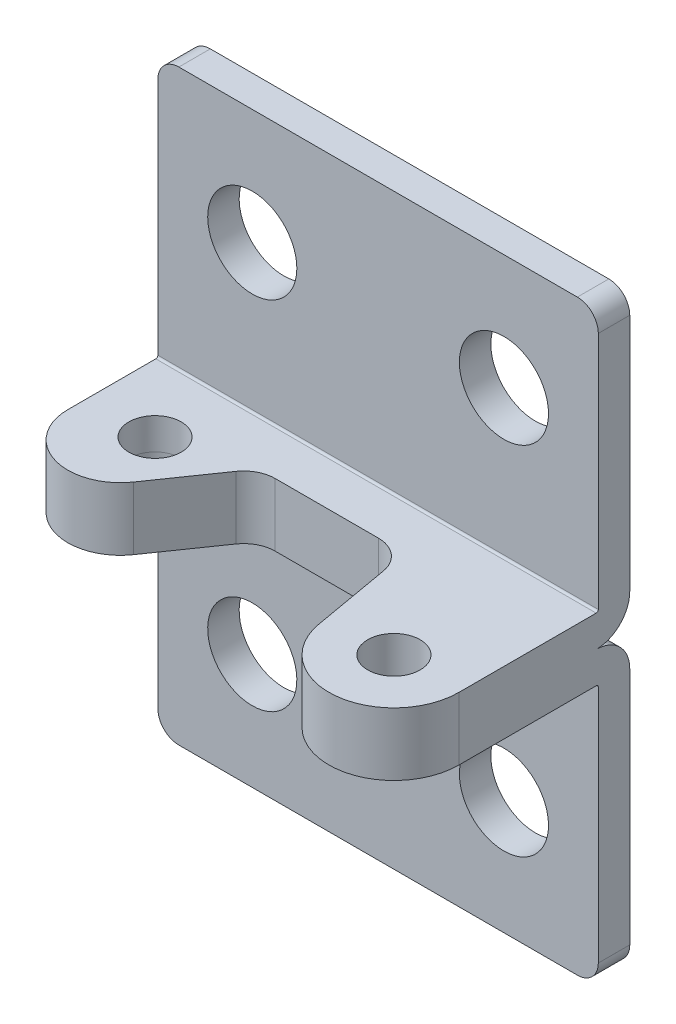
ISO-10303-21;
HEADER;
FILE_DESCRIPTION(('STEP AP214'),'2;1');
FILE_NAME('part.step','',(''),(''),'','','');
FILE_SCHEMA(('AUTOMOTIVE_DESIGN { 1 0 10303 214 1 1 1 1 }'));
ENDSEC;
DATA;
#1=APPLICATION_CONTEXT('core data for automotive mechanical design processes');
#2=APPLICATION_PROTOCOL_DEFINITION('international standard','automotive_design',2000,#1);
#3=PRODUCT_CONTEXT('',#1,'mechanical');
#4=PRODUCT('Part','Part','',(#3));
#5=PRODUCT_RELATED_PRODUCT_CATEGORY('part','',(#4));
#6=PRODUCT_DEFINITION_FORMATION('','',#4);
#7=PRODUCT_DEFINITION_CONTEXT('part definition',#1,'design');
#8=PRODUCT_DEFINITION('design','',#6,#7);
#9=PRODUCT_DEFINITION_SHAPE('','',#8);
#10=(LENGTH_UNIT() NAMED_UNIT(*) SI_UNIT(.MILLI.,.METRE.));
#11=(NAMED_UNIT(*) PLANE_ANGLE_UNIT() SI_UNIT($,.RADIAN.));
#12=(NAMED_UNIT(*) SI_UNIT($,.STERADIAN.) SOLID_ANGLE_UNIT());
#13=UNCERTAINTY_MEASURE_WITH_UNIT(LENGTH_MEASURE(1.E-05),#10,'distance_accuracy_value','');
#14=(GEOMETRIC_REPRESENTATION_CONTEXT(3) GLOBAL_UNCERTAINTY_ASSIGNED_CONTEXT((#13)) GLOBAL_UNIT_ASSIGNED_CONTEXT((#10,
#11,#12)) REPRESENTATION_CONTEXT('',''));
#15=CARTESIAN_POINT('',(0.,0.,0.));
#16=DIRECTION('',(0.,0.,1.));
#17=DIRECTION('',(1.,0.,0.));
#18=AXIS2_PLACEMENT_3D('',#15,#16,#17);
#19=CARTESIAN_POINT('',(-4.,11.799,2.99999999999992));
#20=DIRECTION('',(0.,0.,-1.));
#21=DIRECTION('',(0.,1.,0.));
#22=AXIS2_PLACEMENT_3D('',#19,#20,#21);
#23=PLANE('',#22);
#24=DIRECTION('',(-1.,0.,0.));
#25=VECTOR('',#24,1.);
#26=CARTESIAN_POINT('',(-4.,20.2,2.99999999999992));
#27=LINE('',#26,#25);
#28=CARTESIAN_POINT('',(33.,20.2,2.99999999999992));
#29=VERTEX_POINT('',#28);
#30=CARTESIAN_POINT('',(-9.,20.2,2.99999999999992));
#31=VERTEX_POINT('',#30);
#32=EDGE_CURVE('E355',#29,#31,#27,.T.);
#33=ORIENTED_EDGE('',*,*,#32,.F.);
#34=DIRECTION('',(0.,-1.,0.));
#35=VECTOR('',#34,1.);
#36=CARTESIAN_POINT('',(33.,42.999,2.99999999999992));
#37=LINE('',#36,#35);
#38=CARTESIAN_POINT('',(33.,42.999,2.99999999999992));
#39=VERTEX_POINT('',#38);
#40=EDGE_CURVE('E337',#39,#29,#37,.T.);
#41=ORIENTED_EDGE('',*,*,#40,.F.);
#42=CARTESIAN_POINT('',(31.,42.999,2.99999999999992));
#43=DIRECTION('',(0.,0.,-1.));
#44=DIRECTION('',(1.,0.,0.));
#45=AXIS2_PLACEMENT_3D('',#42,#43,#44);
#46=CIRCLE('',#45,2.);
#47=CARTESIAN_POINT('',(33.,43.,3.));
#48=VERTEX_POINT('',#47);
#49=EDGE_CURVE('E258',#48,#39,#46,.T.);
#50=ORIENTED_EDGE('',*,*,#49,.F.);
#51=CARTESIAN_POINT('',(31.,43.,3.));
#52=DIRECTION('',(0.,0.,1.));
#53=DIRECTION('',(0.,-1.,0.));
#54=AXIS2_PLACEMENT_3D('',#51,#52,#53);
#55=CIRCLE('',#54,2.);
#56=CARTESIAN_POINT('',(31.,45.,3.));
#57=VERTEX_POINT('',#56);
#58=EDGE_CURVE('E277',#48,#57,#55,.T.);
#59=ORIENTED_EDGE('',*,*,#58,.T.);
#60=DIRECTION('',(-1.,0.,0.));
#61=VECTOR('',#60,1.);
#62=CARTESIAN_POINT('',(-7.,45.,3.));
#63=LINE('',#62,#61);
#64=CARTESIAN_POINT('',(-7.,45.,3.));
#65=VERTEX_POINT('',#64);
#66=EDGE_CURVE('E271',#57,#65,#63,.T.);
#67=ORIENTED_EDGE('',*,*,#66,.T.);
#68=CARTESIAN_POINT('',(-7.,43.,3.));
#69=DIRECTION('',(0.,0.,1.));
#70=DIRECTION('',(0.,-1.,0.));
#71=AXIS2_PLACEMENT_3D('',#68,#69,#70);
#72=CIRCLE('',#71,2.);
#73=CARTESIAN_POINT('',(-8.99999975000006,42.9999999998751,2.99999999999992));
#74=VERTEX_POINT('',#73);
#75=EDGE_CURVE('E263',#65,#74,#72,.T.);
#76=ORIENTED_EDGE('',*,*,#75,.T.);
#77=CARTESIAN_POINT('',(-7.,42.999,2.99999999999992));
#78=DIRECTION('',(0.,0.,-1.));
#79=DIRECTION('',(1.,0.,0.));
#80=AXIS2_PLACEMENT_3D('',#77,#78,#79);
#81=CIRCLE('',#80,2.);
#82=CARTESIAN_POINT('',(-9.,42.999,2.99999999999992));
#83=VERTEX_POINT('',#82);
#84=EDGE_CURVE('E246',#83,#74,#81,.T.);
#85=ORIENTED_EDGE('',*,*,#84,.F.);
#86=DIRECTION('',(0.,1.,0.));
#87=VECTOR('',#86,1.);
#88=CARTESIAN_POINT('',(-9.,11.799,2.99999999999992));
#89=LINE('',#88,#87);
#90=EDGE_CURVE('E323',#31,#83,#89,.T.);
#91=ORIENTED_EDGE('',*,*,#90,.F.);
#92=EDGE_LOOP('',(#33,#41,#50,#59,#67,#76,#85,#91));
#93=FACE_BOUND('',#92,.T.);
#94=CARTESIAN_POINT('',(0.,34.,3.));
#95=DIRECTION('',(0.,0.,1.));
#96=DIRECTION('',(0.,-1.,0.));
#97=AXIS2_PLACEMENT_3D('',#94,#95,#96);
#98=CIRCLE('',#97,4.25);
#99=CARTESIAN_POINT('',(0.,29.75,2.99999999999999));
#100=VERTEX_POINT('',#99);
#101=EDGE_CURVE('E299',#100,#100,#98,.T.);
#102=ORIENTED_EDGE('',*,*,#101,.F.);
#103=EDGE_LOOP('',(#102));
#104=FACE_BOUND('',#103,.T.);
#105=CARTESIAN_POINT('',(24.,34.,3.));
#106=DIRECTION('',(0.,0.,1.));
#107=DIRECTION('',(0.,-1.,0.));
#108=AXIS2_PLACEMENT_3D('',#105,#106,#107);
#109=CIRCLE('',#108,4.25);
#110=CARTESIAN_POINT('',(24.,29.75,2.99999999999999));
#111=VERTEX_POINT('',#110);
#112=EDGE_CURVE('E264',#111,#111,#109,.T.);
#113=ORIENTED_EDGE('',*,*,#112,.F.);
#114=EDGE_LOOP('',(#113));
#115=FACE_BOUND('',#114,.T.);
#116=ADVANCED_FACE('F14',(#93,#104,#115),#23,.F.);
#117=CARTESIAN_POINT('',(24.,34.,22.49));
#118=DIRECTION('',(0.,0.,-1.));
#119=DIRECTION('',(0.,1.,0.));
#120=AXIS2_PLACEMENT_3D('',#117,#118,#119);
#121=CYLINDRICAL_SURFACE('',#120,4.25);
#122=CARTESIAN_POINT('',(24.,34.,0.));
#123=DIRECTION('',(0.,0.,-1.));
#124=DIRECTION('',(0.,1.,0.));
#125=AXIS2_PLACEMENT_3D('',#122,#123,#124);
#126=CIRCLE('',#125,4.25);
#127=CARTESIAN_POINT('',(24.,38.25,0.));
#128=VERTEX_POINT('',#127);
#129=EDGE_CURVE('E296',#128,#128,#126,.F.);
#130=ORIENTED_EDGE('',*,*,#129,.F.);
#131=EDGE_LOOP('',(#130));
#132=FACE_BOUND('',#131,.T.);
#133=ORIENTED_EDGE('',*,*,#112,.T.);
#134=EDGE_LOOP('',(#133));
#135=FACE_BOUND('',#134,.T.);
#136=ADVANCED_FACE('F616',(#132,#135),#121,.F.);
#137=CARTESIAN_POINT('',(0.,34.,22.49));
#138=DIRECTION('',(0.,0.,-1.));
#139=DIRECTION('',(0.,1.,0.));
#140=AXIS2_PLACEMENT_3D('',#137,#138,#139);
#141=CYLINDRICAL_SURFACE('',#140,4.25);
#142=CARTESIAN_POINT('',(0.,34.,0.));
#143=DIRECTION('',(0.,0.,-1.));
#144=DIRECTION('',(0.,1.,0.));
#145=AXIS2_PLACEMENT_3D('',#142,#143,#144);
#146=CIRCLE('',#145,4.25);
#147=CARTESIAN_POINT('',(0.,38.25,0.));
#148=VERTEX_POINT('',#147);
#149=EDGE_CURVE('E302',#148,#148,#146,.F.);
#150=ORIENTED_EDGE('',*,*,#149,.F.);
#151=EDGE_LOOP('',(#150));
#152=FACE_BOUND('',#151,.T.);
#153=ORIENTED_EDGE('',*,*,#101,.T.);
#154=EDGE_LOOP('',(#153));
#155=FACE_BOUND('',#154,.T.);
#156=ADVANCED_FACE('F621',(#152,#155),#141,.F.);
#157=CARTESIAN_POINT('',(31.,42.999,2.99999999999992));
#158=DIRECTION('',(0.,0.,-1.));
#159=DIRECTION('',(1.,0.,0.));
#160=AXIS2_PLACEMENT_3D('',#157,#158,#159);
#161=CYLINDRICAL_SURFACE('',#160,2.);
#162=CARTESIAN_POINT('',(31.,42.999,0.));
#163=DIRECTION('',(0.,0.,-1.));
#164=DIRECTION('',(1.,0.,0.));
#165=AXIS2_PLACEMENT_3D('',#162,#163,#164);
#166=CIRCLE('',#165,2.);
#167=CARTESIAN_POINT('',(32.9999997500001,42.9999999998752,0.));
#168=VERTEX_POINT('',#167);
#169=CARTESIAN_POINT('',(33.,42.999,0.));
#170=VERTEX_POINT('',#169);
#171=EDGE_CURVE('E368',#168,#170,#166,.T.);
#172=ORIENTED_EDGE('',*,*,#171,.F.);
#173=DIRECTION('',(0.,0.,1.));
#174=VECTOR('',#173,1.);
#175=CARTESIAN_POINT('',(33.,43.,-42.2676909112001));
#176=LINE('',#175,#174);
#177=EDGE_CURVE('E272',#168,#48,#176,.T.);
#178=ORIENTED_EDGE('',*,*,#177,.T.);
#179=ORIENTED_EDGE('',*,*,#49,.T.);
#180=DIRECTION('',(0.,0.,-1.));
#181=VECTOR('',#180,1.);
#182=CARTESIAN_POINT('',(33.,42.999,2.99999999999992));
#183=LINE('',#182,#181);
#184=EDGE_CURVE('E333',#39,#170,#183,.T.);
#185=ORIENTED_EDGE('',*,*,#184,.T.);
#186=EDGE_LOOP('',(#172,#178,#179,#185));
#187=FACE_BOUND('',#186,.T.);
#188=ADVANCED_FACE('F627',(#187),#161,.T.);
#189=CARTESIAN_POINT('',(31.,43.,-42.2676909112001));
#190=DIRECTION('',(0.,0.,1.));
#191=DIRECTION('',(0.,-1.,0.));
#192=AXIS2_PLACEMENT_3D('',#189,#190,#191);
#193=CYLINDRICAL_SURFACE('',#192,2.);
#194=ORIENTED_EDGE('',*,*,#177,.F.);
#195=CARTESIAN_POINT('',(31.,43.,0.));
#196=DIRECTION('',(0.,0.,-1.));
#197=DIRECTION('',(0.,1.,0.));
#198=AXIS2_PLACEMENT_3D('',#195,#196,#197);
#199=CIRCLE('',#198,2.);
#200=CARTESIAN_POINT('',(31.,45.,0.));
#201=VERTEX_POINT('',#200);
#202=EDGE_CURVE('E275',#168,#201,#199,.F.);
#203=ORIENTED_EDGE('',*,*,#202,.T.);
#204=DIRECTION('',(0.,0.,1.));
#205=VECTOR('',#204,1.);
#206=CARTESIAN_POINT('',(31.,45.,-42.2676909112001));
#207=LINE('',#206,#205);
#208=EDGE_CURVE('E287',#201,#57,#207,.T.);
#209=ORIENTED_EDGE('',*,*,#208,.T.);
#210=ORIENTED_EDGE('',*,*,#58,.F.);
#211=EDGE_LOOP('',(#194,#203,#209,#210));
#212=FACE_BOUND('',#211,.T.);
#213=ADVANCED_FACE('F672',(#212),#193,.T.);
#214=CARTESIAN_POINT('',(-7.,45.,-42.2676909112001));
#215=DIRECTION('',(0.,1.,0.));
#216=DIRECTION('',(0.,0.,1.));
#217=AXIS2_PLACEMENT_3D('',#214,#215,#216);
#218=PLANE('',#217);
#219=ORIENTED_EDGE('',*,*,#208,.F.);
#220=DIRECTION('',(-1.,0.,0.));
#221=VECTOR('',#220,1.);
#222=CARTESIAN_POINT('',(-7.,45.,0.));
#223=LINE('',#222,#221);
#224=CARTESIAN_POINT('',(-7.,45.,0.));
#225=VERTEX_POINT('',#224);
#226=EDGE_CURVE('E284',#201,#225,#223,.T.);
#227=ORIENTED_EDGE('',*,*,#226,.T.);
#228=DIRECTION('',(0.,0.,1.));
#229=VECTOR('',#228,1.);
#230=CARTESIAN_POINT('',(-7.,45.,-42.2676909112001));
#231=LINE('',#230,#229);
#232=EDGE_CURVE('E283',#225,#65,#231,.T.);
#233=ORIENTED_EDGE('',*,*,#232,.T.);
#234=ORIENTED_EDGE('',*,*,#66,.F.);
#235=EDGE_LOOP('',(#219,#227,#233,#234));
#236=FACE_BOUND('',#235,.T.);
#237=ADVANCED_FACE('F682',(#236),#218,.T.);
#238=CARTESIAN_POINT('',(-7.,43.,-42.2676909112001));
#239=DIRECTION('',(0.,0.,1.));
#240=DIRECTION('',(0.,-1.,0.));
#241=AXIS2_PLACEMENT_3D('',#238,#239,#240);
#242=CYLINDRICAL_SURFACE('',#241,2.);
#243=ORIENTED_EDGE('',*,*,#232,.F.);
#244=CARTESIAN_POINT('',(-7.,43.,0.));
#245=DIRECTION('',(0.,0.,-1.));
#246=DIRECTION('',(0.,1.,0.));
#247=AXIS2_PLACEMENT_3D('',#244,#245,#246);
#248=CIRCLE('',#247,2.);
#249=CARTESIAN_POINT('',(-8.99999975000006,42.9999999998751,0.));
#250=VERTEX_POINT('',#249);
#251=EDGE_CURVE('E149',#225,#250,#248,.F.);
#252=ORIENTED_EDGE('',*,*,#251,.T.);
#253=DIRECTION('',(0.,0.,1.));
#254=VECTOR('',#253,1.);
#255=CARTESIAN_POINT('',(-9.,43.,-42.2676909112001));
#256=LINE('',#255,#254);
#257=EDGE_CURVE('E250',#250,#74,#256,.T.);
#258=ORIENTED_EDGE('',*,*,#257,.T.);
#259=ORIENTED_EDGE('',*,*,#75,.F.);
#260=EDGE_LOOP('',(#243,#252,#258,#259));
#261=FACE_BOUND('',#260,.T.);
#262=ADVANCED_FACE('F262',(#261),#242,.T.);
#263=CARTESIAN_POINT('',(-7.,42.999,2.99999999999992));
#264=DIRECTION('',(0.,0.,-1.));
#265=DIRECTION('',(1.,0.,0.));
#266=AXIS2_PLACEMENT_3D('',#263,#264,#265);
#267=CYLINDRICAL_SURFACE('',#266,2.);
#268=ORIENTED_EDGE('',*,*,#257,.F.);
#269=CARTESIAN_POINT('',(-7.,42.999,0.));
#270=DIRECTION('',(0.,0.,-1.));
#271=DIRECTION('',(1.,0.,0.));
#272=AXIS2_PLACEMENT_3D('',#269,#270,#271);
#273=CIRCLE('',#272,2.);
#274=CARTESIAN_POINT('',(-9.,42.999,0.));
#275=VERTEX_POINT('',#274);
#276=EDGE_CURVE('E371',#275,#250,#273,.T.);
#277=ORIENTED_EDGE('',*,*,#276,.F.);
#278=DIRECTION('',(0.,0.,-1.));
#279=VECTOR('',#278,1.);
#280=CARTESIAN_POINT('',(-9.,42.999,2.99999999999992));
#281=LINE('',#280,#279);
#282=EDGE_CURVE('E252',#83,#275,#281,.T.);
#283=ORIENTED_EDGE('',*,*,#282,.F.);
#284=ORIENTED_EDGE('',*,*,#84,.T.);
#285=EDGE_LOOP('',(#268,#277,#283,#284));
#286=FACE_BOUND('',#285,.T.);
#287=ADVANCED_FACE('F248',(#286),#267,.T.);
#288=CARTESIAN_POINT('',(54.1070079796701,20.2,3.19999999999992));
#289=DIRECTION('',(-1.,0.,0.));
#290=DIRECTION('',(0.,-1.,0.));
#291=AXIS2_PLACEMENT_3D('',#288,#289,#290);
#292=CYLINDRICAL_SURFACE('',#291,0.2);
#293=CARTESIAN_POINT('',(-9.,20.2,3.19999999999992));
#294=DIRECTION('',(-1.,0.,0.));
#295=DIRECTION('',(0.,1.,0.));
#296=AXIS2_PLACEMENT_3D('',#293,#294,#295);
#297=CIRCLE('',#296,0.2);
#298=CARTESIAN_POINT('',(-9.,20.,3.19999999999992));
#299=VERTEX_POINT('',#298);
#300=EDGE_CURVE('E340',#31,#299,#297,.T.);
#301=ORIENTED_EDGE('',*,*,#300,.T.);
#302=DIRECTION('',(-1.,0.,0.));
#303=VECTOR('',#302,1.);
#304=CARTESIAN_POINT('',(-4.,20.,3.19999999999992));
#305=LINE('',#304,#303);
#306=CARTESIAN_POINT('',(33.,20.,3.19999999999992));
#307=VERTEX_POINT('',#306);
#308=EDGE_CURVE('E26',#307,#299,#305,.T.);
#309=ORIENTED_EDGE('',*,*,#308,.F.);
#310=CARTESIAN_POINT('',(33.,20.2,3.19999999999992));
#311=DIRECTION('',(1.,0.,0.));
#312=DIRECTION('',(0.,-1.,0.));
#313=AXIS2_PLACEMENT_3D('',#310,#311,#312);
#314=CIRCLE('',#313,0.2);
#315=EDGE_CURVE('E345',#307,#29,#314,.T.);
#316=ORIENTED_EDGE('',*,*,#315,.T.);
#317=ORIENTED_EDGE('',*,*,#32,.T.);
#318=EDGE_LOOP('',(#301,#309,#316,#317));
#319=FACE_BOUND('',#318,.T.);
#320=ADVANCED_FACE('F659',(#319),#292,.F.);
#321=CARTESIAN_POINT('',(4.10506886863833,20.,8.67976956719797));
#322=DIRECTION('',(0.821591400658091,0.,0.570076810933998));
#323=DIRECTION('',(0.,1.,0.));
#324=AXIS2_PLACEMENT_3D('',#321,#322,#323);
#325=PLANE('',#324);
#326=DIRECTION('',(0.,-1.,0.));
#327=VECTOR('',#326,1.);
#328=CARTESIAN_POINT('',(0.107957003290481,20.,14.4403840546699));
#329=LINE('',#328,#327);
#330=CARTESIAN_POINT('',(0.107957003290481,20.,14.4403840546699));
#331=VERTEX_POINT('',#330);
#332=CARTESIAN_POINT('',(0.107957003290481,14.,14.4403840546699));
#333=VERTEX_POINT('',#332);
#334=EDGE_CURVE('E324',#331,#333,#329,.T.);
#335=ORIENTED_EDGE('',*,*,#334,.T.);
#336=DIRECTION('',(-0.570076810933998,0.,0.821591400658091));
#337=VECTOR('',#336,1.);
#338=CARTESIAN_POINT('',(4.10506886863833,14.,8.67976956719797));
#339=LINE('',#338,#337);
#340=CARTESIAN_POINT('',(4.10506886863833,14.,8.67976956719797));
#341=VERTEX_POINT('',#340);
#342=EDGE_CURVE('E490',#341,#333,#339,.T.);
#343=ORIENTED_EDGE('',*,*,#342,.F.);
#344=DIRECTION('',(0.,-1.,0.));
#345=VECTOR('',#344,1.);
#346=CARTESIAN_POINT('',(4.10506886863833,20.,8.67976956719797));
#347=LINE('',#346,#345);
#348=CARTESIAN_POINT('',(4.10506886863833,20.,8.67976956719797));
#349=VERTEX_POINT('',#348);
#350=EDGE_CURVE('E329',#349,#341,#347,.T.);
#351=ORIENTED_EDGE('',*,*,#350,.F.);
#352=DIRECTION('',(-0.570076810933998,0.,0.821591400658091));
#353=VECTOR('',#352,1.);
#354=CARTESIAN_POINT('',(4.10506886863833,20.,8.67976956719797));
#355=LINE('',#354,#353);
#356=EDGE_CURVE('E327',#349,#331,#355,.T.);
#357=ORIENTED_EDGE('',*,*,#356,.T.);
#358=EDGE_LOOP('',(#335,#343,#351,#357));
#359=FACE_BOUND('',#358,.T.);
#360=ADVANCED_FACE('F668',(#359),#325,.T.);
#361=CARTESIAN_POINT('',(6.56984307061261,20.,10.39));
#362=DIRECTION('',(0.,-1.,0.));
#363=DIRECTION('',(1.,0.,0.));
#364=AXIS2_PLACEMENT_3D('',#361,#362,#363);
#365=CYLINDRICAL_SURFACE('',#364,3.);
#366=ORIENTED_EDGE('',*,*,#350,.T.);
#367=CARTESIAN_POINT('',(6.56984307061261,14.,10.39));
#368=DIRECTION('',(0.,1.,0.));
#369=DIRECTION('',(1.,0.,0.));
#370=AXIS2_PLACEMENT_3D('',#367,#368,#369);
#371=CIRCLE('',#370,3.);
#372=CARTESIAN_POINT('',(6.56984307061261,14.,7.38999999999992));
#373=VERTEX_POINT('',#372);
#374=EDGE_CURVE('E494',#373,#341,#371,.T.);
#375=ORIENTED_EDGE('',*,*,#374,.F.);
#376=DIRECTION('',(0.,-1.,0.));
#377=VECTOR('',#376,1.);
#378=CARTESIAN_POINT('',(6.56984307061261,20.,7.38999999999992));
#379=LINE('',#378,#377);
#380=CARTESIAN_POINT('',(6.56984307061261,20.,7.38999999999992));
#381=VERTEX_POINT('',#380);
#382=EDGE_CURVE('E319',#381,#373,#379,.T.);
#383=ORIENTED_EDGE('',*,*,#382,.F.);
#384=CARTESIAN_POINT('',(6.56984307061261,20.,10.39));
#385=DIRECTION('',(0.,1.,0.));
#386=DIRECTION('',(1.,0.,0.));
#387=AXIS2_PLACEMENT_3D('',#384,#385,#386);
#388=CIRCLE('',#387,3.);
#389=EDGE_CURVE('E328',#381,#349,#388,.T.);
#390=ORIENTED_EDGE('',*,*,#389,.T.);
#391=EDGE_LOOP('',(#366,#375,#383,#390));
#392=FACE_BOUND('',#391,.T.);
#393=ADVANCED_FACE('F645',(#392),#365,.F.);
#394=CARTESIAN_POINT('',(16.4177459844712,20.,7.38999999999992));
#395=DIRECTION('',(0.,0.,1.));
#396=DIRECTION('',(1.,0.,0.));
#397=AXIS2_PLACEMENT_3D('',#394,#395,#396);
#398=PLANE('',#397);
#399=ORIENTED_EDGE('',*,*,#382,.T.);
#400=DIRECTION('',(-1.,0.,0.));
#401=VECTOR('',#400,1.);
#402=CARTESIAN_POINT('',(16.4177459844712,14.,7.38999999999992));
#403=LINE('',#402,#401);
#404=CARTESIAN_POINT('',(16.4177459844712,14.,7.38999999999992));
#405=VERTEX_POINT('',#404);
#406=EDGE_CURVE('E511',#405,#373,#403,.T.);
#407=ORIENTED_EDGE('',*,*,#406,.F.);
#408=DIRECTION('',(0.,-1.,0.));
#409=VECTOR('',#408,1.);
#410=CARTESIAN_POINT('',(16.4177459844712,20.,7.38999999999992));
#411=LINE('',#410,#409);
#412=CARTESIAN_POINT('',(16.4177459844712,20.,7.38999999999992));
#413=VERTEX_POINT('',#412);
#414=EDGE_CURVE('E320',#413,#405,#411,.T.);
#415=ORIENTED_EDGE('',*,*,#414,.F.);
#416=DIRECTION('',(-1.,0.,0.));
#417=VECTOR('',#416,1.);
#418=CARTESIAN_POINT('',(16.4177459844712,20.,7.38999999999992));
#419=LINE('',#418,#417);
#420=EDGE_CURVE('E332',#413,#381,#419,.T.);
#421=ORIENTED_EDGE('',*,*,#420,.T.);
#422=EDGE_LOOP('',(#399,#407,#415,#421));
#423=FACE_BOUND('',#422,.T.);
#424=ADVANCED_FACE('F641',(#423),#398,.T.);
#425=CARTESIAN_POINT('',(16.4177459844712,20.,10.39));
#426=DIRECTION('',(0.,-1.,0.));
#427=DIRECTION('',(1.,0.,0.));
#428=AXIS2_PLACEMENT_3D('',#425,#426,#427);
#429=CYLINDRICAL_SURFACE('',#428,3.);
#430=ORIENTED_EDGE('',*,*,#414,.T.);
#431=CARTESIAN_POINT('',(16.4177459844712,14.,10.39));
#432=DIRECTION('',(0.,1.,0.));
#433=DIRECTION('',(1.,0.,0.));
#434=AXIS2_PLACEMENT_3D('',#431,#432,#433);
#435=CIRCLE('',#434,3.);
#436=CARTESIAN_POINT('',(19.3721692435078,14.,9.86905546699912));
#437=VERTEX_POINT('',#436);
#438=EDGE_CURVE('E515',#437,#405,#435,.T.);
#439=ORIENTED_EDGE('',*,*,#438,.F.);
#440=DIRECTION('',(0.,-1.,0.));
#441=VECTOR('',#440,1.);
#442=CARTESIAN_POINT('',(19.3721692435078,20.,9.86905546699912));
#443=LINE('',#442,#441);
#444=CARTESIAN_POINT('',(19.3721692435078,20.,9.86905546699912));
#445=VERTEX_POINT('',#444);
#446=EDGE_CURVE('E387',#445,#437,#443,.T.);
#447=ORIENTED_EDGE('',*,*,#446,.F.);
#448=CARTESIAN_POINT('',(16.4177459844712,20.,10.39));
#449=DIRECTION('',(0.,1.,0.));
#450=DIRECTION('',(1.,0.,0.));
#451=AXIS2_PLACEMENT_3D('',#448,#449,#450);
#452=CIRCLE('',#451,3.);
#453=EDGE_CURVE('E316',#445,#413,#452,.T.);
#454=ORIENTED_EDGE('',*,*,#453,.T.);
#455=EDGE_LOOP('',(#430,#439,#447,#454));
#456=FACE_BOUND('',#455,.T.);
#457=ADVANCED_FACE('F637',(#456),#429,.F.);
#458=CARTESIAN_POINT('',(20.6941919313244,20.,17.3666187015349));
#459=DIRECTION('',(-0.984807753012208,0.,0.173648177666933));
#460=DIRECTION('',(0.,-1.,0.));
#461=AXIS2_PLACEMENT_3D('',#458,#459,#460);
#462=PLANE('',#461);
#463=ORIENTED_EDGE('',*,*,#446,.T.);
#464=DIRECTION('',(-0.173648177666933,0.,-0.984807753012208));
#465=VECTOR('',#464,1.);
#466=CARTESIAN_POINT('',(20.6941919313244,14.,17.3666187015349));
#467=LINE('',#466,#465);
#468=CARTESIAN_POINT('',(20.6941919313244,14.,17.3666187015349));
#469=VERTEX_POINT('',#468);
#470=EDGE_CURVE('E541',#469,#437,#467,.T.);
#471=ORIENTED_EDGE('',*,*,#470,.F.);
#472=DIRECTION('',(0.,-1.,0.));
#473=VECTOR('',#472,1.);
#474=CARTESIAN_POINT('',(20.6941919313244,20.,17.3666187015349));
#475=LINE('',#474,#473);
#476=CARTESIAN_POINT('',(20.6941919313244,20.,17.3666187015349));
#477=VERTEX_POINT('',#476);
#478=EDGE_CURVE('E314',#477,#469,#475,.T.);
#479=ORIENTED_EDGE('',*,*,#478,.F.);
#480=DIRECTION('',(-0.173648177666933,0.,-0.984807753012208));
#481=VECTOR('',#480,1.);
#482=CARTESIAN_POINT('',(20.6941919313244,20.,17.3666187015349));
#483=LINE('',#482,#481);
#484=EDGE_CURVE('E367',#477,#445,#483,.T.);
#485=ORIENTED_EDGE('',*,*,#484,.T.);
#486=EDGE_LOOP('',(#463,#471,#479,#485));
#487=FACE_BOUND('',#486,.T.);
#488=ADVANCED_FACE('F633',(#487),#462,.T.);
#489=CARTESIAN_POINT('',(26.8,20.,16.29));
#490=DIRECTION('',(0.,-1.,0.));
#491=DIRECTION('',(1.,0.,0.));
#492=AXIS2_PLACEMENT_3D('',#489,#490,#491);
#493=CYLINDRICAL_SURFACE('',#492,6.2);
#494=ORIENTED_EDGE('',*,*,#478,.T.);
#495=CARTESIAN_POINT('',(26.8,14.,16.29));
#496=DIRECTION('',(0.,-1.,0.));
#497=DIRECTION('',(1.,0.,0.));
#498=AXIS2_PLACEMENT_3D('',#495,#496,#497);
#499=CIRCLE('',#498,6.2);
#500=CARTESIAN_POINT('',(33.,14.,16.29));
#501=VERTEX_POINT('',#500);
#502=EDGE_CURVE('E548',#501,#469,#499,.T.);
#503=ORIENTED_EDGE('',*,*,#502,.F.);
#504=DIRECTION('',(0.,-1.,0.));
#505=VECTOR('',#504,1.);
#506=CARTESIAN_POINT('',(33.,20.,16.29));
#507=LINE('',#506,#505);
#508=CARTESIAN_POINT('',(33.,20.,16.29));
#509=VERTEX_POINT('',#508);
#510=EDGE_CURVE('E315',#509,#501,#507,.T.);
#511=ORIENTED_EDGE('',*,*,#510,.F.);
#512=CARTESIAN_POINT('',(26.8,20.,16.29));
#513=DIRECTION('',(0.,-1.,0.));
#514=DIRECTION('',(1.,0.,0.));
#515=AXIS2_PLACEMENT_3D('',#512,#513,#514);
#516=CIRCLE('',#515,6.2);
#517=EDGE_CURVE('E348',#509,#477,#516,.T.);
#518=ORIENTED_EDGE('',*,*,#517,.T.);
#519=EDGE_LOOP('',(#494,#503,#511,#518));
#520=FACE_BOUND('',#519,.T.);
#521=ADVANCED_FACE('F636',(#520),#493,.T.);
#522=CARTESIAN_POINT('',(-4.,20.,11.59));
#523=DIRECTION('',(0.,-1.,0.));
#524=DIRECTION('',(1.,0.,0.));
#525=AXIS2_PLACEMENT_3D('',#522,#523,#524);
#526=PLANE('',#525);
#527=DIRECTION('',(0.,0.,1.));
#528=VECTOR('',#527,1.);
#529=CARTESIAN_POINT('',(33.,20.,-19.61));
#530=LINE('',#529,#528);
#531=EDGE_CURVE('E311',#307,#509,#530,.T.);
#532=ORIENTED_EDGE('',*,*,#531,.F.);
#533=ORIENTED_EDGE('',*,*,#308,.T.);
#534=DIRECTION('',(0.,0.,-1.));
#535=VECTOR('',#534,1.);
#536=CARTESIAN_POINT('',(-9.,20.,11.59));
#537=LINE('',#536,#535);
#538=CARTESIAN_POINT('',(-9.,20.,11.59));
#539=VERTEX_POINT('',#538);
#540=EDGE_CURVE('E358',#539,#299,#537,.T.);
#541=ORIENTED_EDGE('',*,*,#540,.F.);
#542=CARTESIAN_POINT('',(-4.,20.,11.59));
#543=DIRECTION('',(0.,-1.,0.));
#544=DIRECTION('',(1.,0.,0.));
#545=AXIS2_PLACEMENT_3D('',#542,#543,#544);
#546=CIRCLE('',#545,5.);
#547=EDGE_CURVE('E372',#331,#539,#546,.T.);
#548=ORIENTED_EDGE('',*,*,#547,.F.);
#549=ORIENTED_EDGE('',*,*,#356,.F.);
#550=ORIENTED_EDGE('',*,*,#389,.F.);
#551=ORIENTED_EDGE('',*,*,#420,.F.);
#552=ORIENTED_EDGE('',*,*,#453,.F.);
#553=ORIENTED_EDGE('',*,*,#484,.F.);
#554=ORIENTED_EDGE('',*,*,#517,.F.);
#555=EDGE_LOOP('',(#532,#533,#541,#548,#549,#550,#551,#552,#553,#554));
#556=FACE_BOUND('',#555,.T.);
#557=CARTESIAN_POINT('',(-2.57869666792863,20.,9.69325696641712));
#558=DIRECTION('',(0.,-1.,0.));
#559=DIRECTION('',(1.,0.,0.));
#560=AXIS2_PLACEMENT_3D('',#557,#558,#559);
#561=CIRCLE('',#560,2.5);
#562=CARTESIAN_POINT('',(-0.07869666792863,20.,9.69325696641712));
#563=VERTEX_POINT('',#562);
#564=EDGE_CURVE('E308',#563,#563,#561,.F.);
#565=ORIENTED_EDGE('',*,*,#564,.F.);
#566=EDGE_LOOP('',(#565));
#567=FACE_BOUND('',#566,.T.);
#568=CARTESIAN_POINT('',(26.8,20.,16.29));
#569=DIRECTION('',(0.,-1.,0.));
#570=DIRECTION('',(1.,0.,0.));
#571=AXIS2_PLACEMENT_3D('',#568,#569,#570);
#572=CIRCLE('',#571,2.49999999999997);
#573=CARTESIAN_POINT('',(29.3,20.,16.29));
#574=VERTEX_POINT('',#573);
#575=EDGE_CURVE('E305',#574,#574,#572,.F.);
#576=ORIENTED_EDGE('',*,*,#575,.F.);
#577=EDGE_LOOP('',(#576));
#578=FACE_BOUND('',#577,.T.);
#579=ADVANCED_FACE('F647',(#556,#567,#578),#526,.F.);
#580=CARTESIAN_POINT('',(26.8,17.,16.29));
#581=DIRECTION('',(0.,-1.,0.));
#582=DIRECTION('',(1.,0.,0.));
#583=AXIS2_PLACEMENT_3D('',#580,#581,#582);
#584=CYLINDRICAL_SURFACE('',#583,2.5);
#585=ORIENTED_EDGE('',*,*,#575,.T.);
#586=EDGE_LOOP('',(#585));
#587=FACE_BOUND('',#586,.T.);
#588=CARTESIAN_POINT('',(26.8,14.,16.29));
#589=DIRECTION('',(0.,-1.,0.));
#590=DIRECTION('',(1.,0.,0.));
#591=AXIS2_PLACEMENT_3D('',#588,#589,#590);
#592=CIRCLE('',#591,2.49999999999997);
#593=CARTESIAN_POINT('',(29.3,14.,16.29));
#594=VERTEX_POINT('',#593);
#595=EDGE_CURVE('E483',#594,#594,#592,.T.);
#596=ORIENTED_EDGE('',*,*,#595,.T.);
#597=EDGE_LOOP('',(#596));
#598=FACE_BOUND('',#597,.T.);
#599=ADVANCED_FACE('F434',(#587,#598),#584,.F.);
#600=CARTESIAN_POINT('',(-2.57869666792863,44.999,9.69325696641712));
#601=DIRECTION('',(0.,-1.,0.));
#602=DIRECTION('',(1.,0.,0.));
#603=AXIS2_PLACEMENT_3D('',#600,#601,#602);
#604=CYLINDRICAL_SURFACE('',#603,2.5);
#605=ORIENTED_EDGE('',*,*,#564,.T.);
#606=EDGE_LOOP('',(#605));
#607=FACE_BOUND('',#606,.T.);
#608=CARTESIAN_POINT('',(-2.57869666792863,17.,9.69325696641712));
#609=DIRECTION('',(0.,-1.,0.));
#610=DIRECTION('',(-0.92868349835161,0.,0.370873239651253));
#611=AXIS2_PLACEMENT_3D('',#608,#609,#610);
#612=CIRCLE('',#611,2.5);
#613=CARTESIAN_POINT('',(-4.90040541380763,17.,10.6204400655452));
#614=VERTEX_POINT('',#613);
#615=CARTESIAN_POINT('',(-0.258291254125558,17.,8.76281690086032));
#616=VERTEX_POINT('',#615);
#617=EDGE_CURVE('E9',#614,#616,#612,.T.);
#618=ORIENTED_EDGE('',*,*,#617,.T.);
#619=CARTESIAN_POINT('',(-2.57869666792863,17.,9.69325696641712));
#620=DIRECTION('',(0.,-1.,0.));
#621=DIRECTION('',(0.928162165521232,0.,-0.372176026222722));
#622=AXIS2_PLACEMENT_3D('',#619,#620,#621);
#623=CIRCLE('',#622,2.5);
#624=EDGE_CURVE('E33',#616,#614,#623,.T.);
#625=ORIENTED_EDGE('',*,*,#624,.T.);
#626=EDGE_LOOP('',(#618,#625));
#627=FACE_BOUND('',#626,.T.);
#628=ADVANCED_FACE('F423',(#607,#627),#604,.F.);
#629=CARTESIAN_POINT('',(-4.,20.,11.59));
#630=DIRECTION('',(0.,-1.,0.));
#631=DIRECTION('',(1.,0.,0.));
#632=AXIS2_PLACEMENT_3D('',#629,#630,#631);
#633=CYLINDRICAL_SURFACE('',#632,5.);
#634=DIRECTION('',(0.,-1.,0.));
#635=VECTOR('',#634,1.);
#636=CARTESIAN_POINT('',(-9.,20.,11.59));
#637=LINE('',#636,#635);
#638=CARTESIAN_POINT('',(-9.,14.,11.59));
#639=VERTEX_POINT('',#638);
#640=EDGE_CURVE('E376',#539,#639,#637,.T.);
#641=ORIENTED_EDGE('',*,*,#640,.T.);
#642=CARTESIAN_POINT('',(-4.,14.,11.59));
#643=DIRECTION('',(0.,-1.,0.));
#644=DIRECTION('',(1.,0.,0.));
#645=AXIS2_PLACEMENT_3D('',#642,#643,#644);
#646=CIRCLE('',#645,5.);
#647=EDGE_CURVE('E495',#333,#639,#646,.T.);
#648=ORIENTED_EDGE('',*,*,#647,.F.);
#649=ORIENTED_EDGE('',*,*,#334,.F.);
#650=ORIENTED_EDGE('',*,*,#547,.T.);
#651=EDGE_LOOP('',(#641,#648,#649,#650));
#652=FACE_BOUND('',#651,.T.);
#653=ADVANCED_FACE('F433',(#652),#633,.T.);
#654=CARTESIAN_POINT('',(-4.,11.799,0.));
#655=DIRECTION('',(0.,0.,-1.));
#656=DIRECTION('',(0.,1.,0.));
#657=AXIS2_PLACEMENT_3D('',#654,#655,#656);
#658=PLANE('',#657);
#659=ORIENTED_EDGE('',*,*,#276,.T.);
#660=ORIENTED_EDGE('',*,*,#251,.F.);
#661=ORIENTED_EDGE('',*,*,#226,.F.);
#662=ORIENTED_EDGE('',*,*,#202,.F.);
#663=ORIENTED_EDGE('',*,*,#171,.T.);
#664=DIRECTION('',(0.,-1.,0.));
#665=VECTOR('',#664,1.);
#666=CARTESIAN_POINT('',(33.,42.999,0.));
#667=LINE('',#666,#665);
#668=CARTESIAN_POINT('',(33.,20.2,0.));
#669=VERTEX_POINT('',#668);
#670=EDGE_CURVE('E349',#170,#669,#667,.T.);
#671=ORIENTED_EDGE('',*,*,#670,.T.);
#672=DIRECTION('',(-1.,0.,0.));
#673=VECTOR('',#672,1.);
#674=CARTESIAN_POINT('',(-4.,20.2,0.));
#675=LINE('',#674,#673);
#676=CARTESIAN_POINT('',(-9.,20.2,0.));
#677=VERTEX_POINT('',#676);
#678=EDGE_CURVE('E352',#669,#677,#675,.T.);
#679=ORIENTED_EDGE('',*,*,#678,.T.);
#680=DIRECTION('',(0.,1.,0.));
#681=VECTOR('',#680,1.);
#682=CARTESIAN_POINT('',(-9.,11.799,0.));
#683=LINE('',#682,#681);
#684=EDGE_CURVE('E364',#677,#275,#683,.T.);
#685=ORIENTED_EDGE('',*,*,#684,.T.);
#686=EDGE_LOOP('',(#659,#660,#661,#662,#663,#671,#679,#685));
#687=FACE_BOUND('',#686,.T.);
#688=ORIENTED_EDGE('',*,*,#149,.T.);
#689=EDGE_LOOP('',(#688));
#690=FACE_BOUND('',#689,.T.);
#691=ORIENTED_EDGE('',*,*,#129,.T.);
#692=EDGE_LOOP('',(#691));
#693=FACE_BOUND('',#692,.T.);
#694=ADVANCED_FACE('F655',(#687,#690,#693),#658,.T.);
#695=CARTESIAN_POINT('',(54.1070079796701,20.2,3.19999999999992));
#696=DIRECTION('',(-1.,0.,0.));
#697=DIRECTION('',(0.,-1.,0.));
#698=AXIS2_PLACEMENT_3D('',#695,#696,#697);
#699=CYLINDRICAL_SURFACE('',#698,3.2);
#700=CARTESIAN_POINT('',(-9.,20.2,3.19999999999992));
#701=DIRECTION('',(-1.,0.,0.));
#702=DIRECTION('',(0.,-1.,0.));
#703=AXIS2_PLACEMENT_3D('',#700,#701,#702);
#704=CIRCLE('',#703,3.2);
#705=CARTESIAN_POINT('',(-9.,17.,3.19999999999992));
#706=VERTEX_POINT('',#705);
#707=EDGE_CURVE('E344',#677,#706,#704,.T.);
#708=ORIENTED_EDGE('',*,*,#707,.F.);
#709=ORIENTED_EDGE('',*,*,#678,.F.);
#710=CARTESIAN_POINT('',(33.,20.2,3.19999999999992));
#711=DIRECTION('',(1.,0.,0.));
#712=DIRECTION('',(0.,-1.,0.));
#713=AXIS2_PLACEMENT_3D('',#710,#711,#712);
#714=CIRCLE('',#713,3.2);
#715=CARTESIAN_POINT('',(33.,17.,3.19999999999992));
#716=VERTEX_POINT('',#715);
#717=EDGE_CURVE('E361',#716,#669,#714,.T.);
#718=ORIENTED_EDGE('',*,*,#717,.F.);
#719=DIRECTION('',(-1.,0.,0.));
#720=VECTOR('',#719,1.);
#721=CARTESIAN_POINT('',(-4.,17.,3.19999999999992));
#722=LINE('',#721,#720);
#723=EDGE_CURVE('E257',#716,#706,#722,.T.);
#724=ORIENTED_EDGE('',*,*,#723,.T.);
#725=EDGE_LOOP('',(#708,#709,#718,#724));
#726=FACE_BOUND('',#725,.T.);
#727=ADVANCED_FACE('F651',(#726),#699,.T.);
#728=CARTESIAN_POINT('',(-9.,20.,11.59));
#729=DIRECTION('',(-1.,0.,0.));
#730=DIRECTION('',(0.,-1.,0.));
#731=AXIS2_PLACEMENT_3D('',#728,#729,#730);
#732=PLANE('',#731);
#733=ORIENTED_EDGE('',*,*,#540,.T.);
#734=ORIENTED_EDGE('',*,*,#300,.F.);
#735=ORIENTED_EDGE('',*,*,#90,.T.);
#736=ORIENTED_EDGE('',*,*,#282,.T.);
#737=ORIENTED_EDGE('',*,*,#684,.F.);
#738=ORIENTED_EDGE('',*,*,#707,.T.);
#739=CARTESIAN_POINT('',(-9.,13.8,3.19999999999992));
#740=DIRECTION('',(1.,0.,0.));
#741=DIRECTION('',(0.,-1.,0.));
#742=AXIS2_PLACEMENT_3D('',#739,#740,#741);
#743=CIRCLE('',#742,3.2);
#744=CARTESIAN_POINT('',(-9.,13.7999999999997,0.));
#745=VERTEX_POINT('',#744);
#746=EDGE_CURVE('E506',#745,#706,#743,.T.);
#747=ORIENTED_EDGE('',*,*,#746,.F.);
#748=DIRECTION('',(0.,-1.,0.));
#749=VECTOR('',#748,1.);
#750=CARTESIAN_POINT('',(-9.,22.201,0.));
#751=LINE('',#750,#749);
#752=CARTESIAN_POINT('',(-9.,-8.999,0.));
#753=VERTEX_POINT('',#752);
#754=EDGE_CURVE('E531',#745,#753,#751,.T.);
#755=ORIENTED_EDGE('',*,*,#754,.T.);
#756=DIRECTION('',(0.,0.,1.));
#757=VECTOR('',#756,1.);
#758=CARTESIAN_POINT('',(-9.,-8.999,0.));
#759=LINE('',#758,#757);
#760=CARTESIAN_POINT('',(-9.,-8.999,2.99999999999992));
#761=VERTEX_POINT('',#760);
#762=EDGE_CURVE('E489',#753,#761,#759,.T.);
#763=ORIENTED_EDGE('',*,*,#762,.T.);
#764=DIRECTION('',(0.,-1.,0.));
#765=VECTOR('',#764,1.);
#766=CARTESIAN_POINT('',(-9.,22.201,2.99999999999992));
#767=LINE('',#766,#765);
#768=CARTESIAN_POINT('',(-9.,13.8,2.99999999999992));
#769=VERTEX_POINT('',#768);
#770=EDGE_CURVE('E500',#769,#761,#767,.T.);
#771=ORIENTED_EDGE('',*,*,#770,.F.);
#772=CARTESIAN_POINT('',(-9.,13.8,3.19999999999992));
#773=DIRECTION('',(1.,0.,0.));
#774=DIRECTION('',(0.,-1.,0.));
#775=AXIS2_PLACEMENT_3D('',#772,#773,#774);
#776=CIRCLE('',#775,0.2);
#777=CARTESIAN_POINT('',(-9.,14.,3.19999999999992));
#778=VERTEX_POINT('',#777);
#779=EDGE_CURVE('E501',#769,#778,#776,.T.);
#780=ORIENTED_EDGE('',*,*,#779,.T.);
#781=DIRECTION('',(0.,0.,-1.));
#782=VECTOR('',#781,1.);
#783=CARTESIAN_POINT('',(-9.,14.,11.59));
#784=LINE('',#783,#782);
#785=EDGE_CURVE('E507',#639,#778,#784,.T.);
#786=ORIENTED_EDGE('',*,*,#785,.F.);
#787=ORIENTED_EDGE('',*,*,#640,.F.);
#788=EDGE_LOOP('',(#733,#734,#735,#736,#737,#738,#747,#755,#763,#771,#780,#786,#787));
#789=FACE_BOUND('',#788,.T.);
#790=ADVANCED_FACE('F654',(#789),#732,.T.);
#791=CARTESIAN_POINT('',(33.,20.,-19.61));
#792=DIRECTION('',(1.,0.,0.));
#793=DIRECTION('',(0.,0.,1.));
#794=AXIS2_PLACEMENT_3D('',#791,#792,#793);
#795=PLANE('',#794);
#796=DIRECTION('',(0.,0.,1.));
#797=VECTOR('',#796,1.);
#798=CARTESIAN_POINT('',(33.,14.,-19.61));
#799=LINE('',#798,#797);
#800=CARTESIAN_POINT('',(33.,14.,3.19999999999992));
#801=VERTEX_POINT('',#800);
#802=EDGE_CURVE('E281',#801,#501,#799,.T.);
#803=ORIENTED_EDGE('',*,*,#802,.F.);
#804=CARTESIAN_POINT('',(33.,13.8,3.19999999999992));
#805=DIRECTION('',(-1.,0.,0.));
#806=DIRECTION('',(0.,-1.,0.));
#807=AXIS2_PLACEMENT_3D('',#804,#805,#806);
#808=CIRCLE('',#807,0.2);
#809=CARTESIAN_POINT('',(33.,13.8,2.99999999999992));
#810=VERTEX_POINT('',#809);
#811=EDGE_CURVE('E505',#801,#810,#808,.T.);
#812=ORIENTED_EDGE('',*,*,#811,.T.);
#813=DIRECTION('',(0.,1.,0.));
#814=VECTOR('',#813,1.);
#815=CARTESIAN_POINT('',(33.,-8.999,2.99999999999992));
#816=LINE('',#815,#814);
#817=CARTESIAN_POINT('',(33.,-8.999,2.99999999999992));
#818=VERTEX_POINT('',#817);
#819=EDGE_CURVE('E516',#818,#810,#816,.T.);
#820=ORIENTED_EDGE('',*,*,#819,.F.);
#821=DIRECTION('',(0.,0.,1.));
#822=VECTOR('',#821,1.);
#823=CARTESIAN_POINT('',(33.,-8.999,0.));
#824=LINE('',#823,#822);
#825=CARTESIAN_POINT('',(33.,-8.999,0.));
#826=VERTEX_POINT('',#825);
#827=EDGE_CURVE('E534',#826,#818,#824,.T.);
#828=ORIENTED_EDGE('',*,*,#827,.F.);
#829=DIRECTION('',(0.,1.,0.));
#830=VECTOR('',#829,1.);
#831=CARTESIAN_POINT('',(33.,-8.999,0.));
#832=LINE('',#831,#830);
#833=CARTESIAN_POINT('',(33.,13.8,0.));
#834=VERTEX_POINT('',#833);
#835=EDGE_CURVE('E519',#826,#834,#832,.T.);
#836=ORIENTED_EDGE('',*,*,#835,.T.);
#837=CARTESIAN_POINT('',(33.,13.8,3.19999999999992));
#838=DIRECTION('',(-1.,0.,0.));
#839=DIRECTION('',(0.,1.,0.));
#840=AXIS2_PLACEMENT_3D('',#837,#838,#839);
#841=CIRCLE('',#840,3.2);
#842=EDGE_CURVE('E561',#716,#834,#841,.T.);
#843=ORIENTED_EDGE('',*,*,#842,.F.);
#844=ORIENTED_EDGE('',*,*,#717,.T.);
#845=ORIENTED_EDGE('',*,*,#670,.F.);
#846=ORIENTED_EDGE('',*,*,#184,.F.);
#847=ORIENTED_EDGE('',*,*,#40,.T.);
#848=ORIENTED_EDGE('',*,*,#315,.F.);
#849=ORIENTED_EDGE('',*,*,#531,.T.);
#850=ORIENTED_EDGE('',*,*,#510,.T.);
#851=EDGE_LOOP('',(#803,#812,#820,#828,#836,#843,#844,#845,#846,#847,#848,#849,#850));
#852=FACE_BOUND('',#851,.T.);
#853=ADVANCED_FACE('F436',(#852),#795,.T.);
#854=CARTESIAN_POINT('',(-4.,22.201,2.99999999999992));
#855=DIRECTION('',(0.,0.,1.));
#856=DIRECTION('',(1.,0.,0.));
#857=AXIS2_PLACEMENT_3D('',#854,#855,#856);
#858=PLANE('',#857);
#859=ORIENTED_EDGE('',*,*,#770,.T.);
#860=CARTESIAN_POINT('',(-7.,-8.999,2.99999999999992));
#861=DIRECTION('',(0.,0.,1.));
#862=DIRECTION('',(1.,0.,0.));
#863=AXIS2_PLACEMENT_3D('',#860,#861,#862);
#864=CIRCLE('',#863,2.);
#865=CARTESIAN_POINT('',(-8.99999975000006,-8.99999999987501,2.99999999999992));
#866=VERTEX_POINT('',#865);
#867=EDGE_CURVE('E496',#761,#866,#864,.T.);
#868=ORIENTED_EDGE('',*,*,#867,.T.);
#869=CARTESIAN_POINT('',(-7.,-9.,3.));
#870=DIRECTION('',(0.,0.,1.));
#871=DIRECTION('',(0.,1.,0.));
#872=AXIS2_PLACEMENT_3D('',#869,#870,#871);
#873=CIRCLE('',#872,2.);
#874=CARTESIAN_POINT('',(-7.,-11.,3.));
#875=VERTEX_POINT('',#874);
#876=EDGE_CURVE('E454',#866,#875,#873,.T.);
#877=ORIENTED_EDGE('',*,*,#876,.T.);
#878=DIRECTION('',(1.,0.,0.));
#879=VECTOR('',#878,1.);
#880=CARTESIAN_POINT('',(-7.,-11.,3.));
#881=LINE('',#880,#879);
#882=CARTESIAN_POINT('',(31.,-11.,3.));
#883=VERTEX_POINT('',#882);
#884=EDGE_CURVE('E457',#875,#883,#881,.T.);
#885=ORIENTED_EDGE('',*,*,#884,.T.);
#886=CARTESIAN_POINT('',(31.,-9.,3.));
#887=DIRECTION('',(0.,0.,1.));
#888=DIRECTION('',(0.,1.,0.));
#889=AXIS2_PLACEMENT_3D('',#886,#887,#888);
#890=CIRCLE('',#889,2.);
#891=CARTESIAN_POINT('',(32.9999997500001,-8.99999999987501,2.99999999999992));
#892=VERTEX_POINT('',#891);
#893=EDGE_CURVE('E460',#883,#892,#890,.T.);
#894=ORIENTED_EDGE('',*,*,#893,.T.);
#895=CARTESIAN_POINT('',(31.,-8.999,2.99999999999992));
#896=DIRECTION('',(0.,0.,1.));
#897=DIRECTION('',(1.,0.,0.));
#898=AXIS2_PLACEMENT_3D('',#895,#896,#897);
#899=CIRCLE('',#898,2.);
#900=EDGE_CURVE('E133',#892,#818,#899,.T.);
#901=ORIENTED_EDGE('',*,*,#900,.T.);
#902=ORIENTED_EDGE('',*,*,#819,.T.);
#903=DIRECTION('',(-1.,0.,0.));
#904=VECTOR('',#903,1.);
#905=CARTESIAN_POINT('',(-4.,13.8,2.99999999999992));
#906=LINE('',#905,#904);
#907=EDGE_CURVE('E520',#810,#769,#906,.T.);
#908=ORIENTED_EDGE('',*,*,#907,.T.);
#909=EDGE_LOOP('',(#859,#868,#877,#885,#894,#901,#902,#908));
#910=FACE_BOUND('',#909,.T.);
#911=CARTESIAN_POINT('',(0.,0.,3.));
#912=DIRECTION('',(0.,0.,1.));
#913=DIRECTION('',(0.,-1.,0.));
#914=AXIS2_PLACEMENT_3D('',#911,#912,#913);
#915=CIRCLE('',#914,4.25);
#916=CARTESIAN_POINT('',(0.,-4.24999999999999,3.00000000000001));
#917=VERTEX_POINT('',#916);
#918=EDGE_CURVE('E477',#917,#917,#915,.T.);
#919=ORIENTED_EDGE('',*,*,#918,.F.);
#920=EDGE_LOOP('',(#919));
#921=FACE_BOUND('',#920,.T.);
#922=CARTESIAN_POINT('',(24.,0.,3.));
#923=DIRECTION('',(0.,0.,1.));
#924=DIRECTION('',(0.,-1.,0.));
#925=AXIS2_PLACEMENT_3D('',#922,#923,#924);
#926=CIRCLE('',#925,4.25);
#927=CARTESIAN_POINT('',(24.,-4.24999999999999,3.00000000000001));
#928=VERTEX_POINT('',#927);
#929=EDGE_CURVE('E471',#928,#928,#926,.T.);
#930=ORIENTED_EDGE('',*,*,#929,.F.);
#931=EDGE_LOOP('',(#930));
#932=FACE_BOUND('',#931,.T.);
#933=ADVANCED_FACE('F593',(#910,#921,#932),#858,.T.);
#934=CARTESIAN_POINT('',(24.,0.,22.49));
#935=DIRECTION('',(0.,0.,-1.));
#936=DIRECTION('',(0.,1.,0.));
#937=AXIS2_PLACEMENT_3D('',#934,#935,#936);
#938=CYLINDRICAL_SURFACE('',#937,4.25);
#939=ORIENTED_EDGE('',*,*,#929,.T.);
#940=EDGE_LOOP('',(#939));
#941=FACE_BOUND('',#940,.T.);
#942=CARTESIAN_POINT('',(24.,0.,0.));
#943=DIRECTION('',(0.,0.,1.));
#944=DIRECTION('',(0.,-1.,0.));
#945=AXIS2_PLACEMENT_3D('',#942,#943,#944);
#946=CIRCLE('',#945,4.25);
#947=CARTESIAN_POINT('',(24.,-4.25,0.));
#948=VERTEX_POINT('',#947);
#949=EDGE_CURVE('E474',#948,#948,#946,.F.);
#950=ORIENTED_EDGE('',*,*,#949,.T.);
#951=EDGE_LOOP('',(#950));
#952=FACE_BOUND('',#951,.T.);
#953=ADVANCED_FACE('F797',(#941,#952),#938,.F.);
#954=CARTESIAN_POINT('',(0.,0.,22.49));
#955=DIRECTION('',(0.,0.,-1.));
#956=DIRECTION('',(0.,1.,0.));
#957=AXIS2_PLACEMENT_3D('',#954,#955,#956);
#958=CYLINDRICAL_SURFACE('',#957,4.25);
#959=ORIENTED_EDGE('',*,*,#918,.T.);
#960=EDGE_LOOP('',(#959));
#961=FACE_BOUND('',#960,.T.);
#962=CARTESIAN_POINT('',(0.,0.,0.));
#963=DIRECTION('',(0.,0.,1.));
#964=DIRECTION('',(0.,-1.,0.));
#965=AXIS2_PLACEMENT_3D('',#962,#963,#964);
#966=CIRCLE('',#965,4.25);
#967=CARTESIAN_POINT('',(0.,-4.25,0.));
#968=VERTEX_POINT('',#967);
#969=EDGE_CURVE('E480',#968,#968,#966,.F.);
#970=ORIENTED_EDGE('',*,*,#969,.T.);
#971=EDGE_LOOP('',(#970));
#972=FACE_BOUND('',#971,.T.);
#973=ADVANCED_FACE('F592',(#961,#972),#958,.F.);
#974=CARTESIAN_POINT('',(-7.,-11.0000000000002,-42.2435040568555));
#975=DIRECTION('',(0.,-1.,0.));
#976=DIRECTION('',(0.,0.,-1.));
#977=AXIS2_PLACEMENT_3D('',#974,#975,#976);
#978=PLANE('',#977);
#979=DIRECTION('',(-1.,0.,0.));
#980=VECTOR('',#979,1.);
#981=CARTESIAN_POINT('',(-7.,-11.,0.));
#982=LINE('',#981,#980);
#983=CARTESIAN_POINT('',(31.,-11.,0.));
#984=VERTEX_POINT('',#983);
#985=CARTESIAN_POINT('',(-7.,-11.,0.));
#986=VERTEX_POINT('',#985);
#987=EDGE_CURVE('E443',#984,#986,#982,.T.);
#988=ORIENTED_EDGE('',*,*,#987,.F.);
#989=DIRECTION('',(0.,0.,1.));
#990=VECTOR('',#989,1.);
#991=CARTESIAN_POINT('',(31.,-11.0000000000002,-42.2435040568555));
#992=LINE('',#991,#990);
#993=EDGE_CURVE('E465',#984,#883,#992,.T.);
#994=ORIENTED_EDGE('',*,*,#993,.T.);
#995=ORIENTED_EDGE('',*,*,#884,.F.);
#996=DIRECTION('',(0.,0.,1.));
#997=VECTOR('',#996,1.);
#998=CARTESIAN_POINT('',(-7.,-11.0000000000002,-42.2435040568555));
#999=LINE('',#998,#997);
#1000=EDGE_CURVE('E467',#986,#875,#999,.T.);
#1001=ORIENTED_EDGE('',*,*,#1000,.F.);
#1002=EDGE_LOOP('',(#988,#994,#995,#1001));
#1003=FACE_BOUND('',#1002,.T.);
#1004=ADVANCED_FACE('F814',(#1003),#978,.T.);
#1005=CARTESIAN_POINT('',(31.,-9.00000000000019,-42.2435040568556));
#1006=DIRECTION('',(0.,0.,1.));
#1007=DIRECTION('',(0.,-1.,0.));
#1008=AXIS2_PLACEMENT_3D('',#1005,#1006,#1007);
#1009=CYLINDRICAL_SURFACE('',#1008,2.);
#1010=CARTESIAN_POINT('',(31.,-9.,0.));
#1011=DIRECTION('',(0.,0.,1.));
#1012=DIRECTION('',(0.,-1.,0.));
#1013=AXIS2_PLACEMENT_3D('',#1010,#1011,#1012);
#1014=CIRCLE('',#1013,2.);
#1015=CARTESIAN_POINT('',(33.,-9.,0.));
#1016=VERTEX_POINT('',#1015);
#1017=EDGE_CURVE('E450',#1016,#984,#1014,.F.);
#1018=ORIENTED_EDGE('',*,*,#1017,.F.);
#1019=DIRECTION('',(0.,0.,1.));
#1020=VECTOR('',#1019,1.);
#1021=CARTESIAN_POINT('',(33.,-9.00000000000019,-42.2435040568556));
#1022=LINE('',#1021,#1020);
#1023=EDGE_CURVE('E451',#1016,#892,#1022,.T.);
#1024=ORIENTED_EDGE('',*,*,#1023,.T.);
#1025=ORIENTED_EDGE('',*,*,#893,.F.);
#1026=ORIENTED_EDGE('',*,*,#993,.F.);
#1027=EDGE_LOOP('',(#1018,#1024,#1025,#1026));
#1028=FACE_BOUND('',#1027,.T.);
#1029=ADVANCED_FACE('F807',(#1028),#1009,.T.);
#1030=CARTESIAN_POINT('',(31.,-8.999,0.));
#1031=DIRECTION('',(0.,0.,1.));
#1032=DIRECTION('',(1.,0.,0.));
#1033=AXIS2_PLACEMENT_3D('',#1030,#1031,#1032);
#1034=CYLINDRICAL_SURFACE('',#1033,2.);
#1035=ORIENTED_EDGE('',*,*,#1023,.F.);
#1036=CARTESIAN_POINT('',(31.,-8.999,0.));
#1037=DIRECTION('',(0.,0.,1.));
#1038=DIRECTION('',(1.,0.,0.));
#1039=AXIS2_PLACEMENT_3D('',#1036,#1037,#1038);
#1040=CIRCLE('',#1039,2.);
#1041=EDGE_CURVE('E537',#1016,#826,#1040,.T.);
#1042=ORIENTED_EDGE('',*,*,#1041,.T.);
#1043=ORIENTED_EDGE('',*,*,#827,.T.);
#1044=ORIENTED_EDGE('',*,*,#900,.F.);
#1045=EDGE_LOOP('',(#1035,#1042,#1043,#1044));
#1046=FACE_BOUND('',#1045,.T.);
#1047=ADVANCED_FACE('F614',(#1046),#1034,.T.);
#1048=CARTESIAN_POINT('',(-7.,-8.999,0.));
#1049=DIRECTION('',(0.,0.,1.));
#1050=DIRECTION('',(1.,0.,0.));
#1051=AXIS2_PLACEMENT_3D('',#1048,#1049,#1050);
#1052=CYLINDRICAL_SURFACE('',#1051,2.);
#1053=ORIENTED_EDGE('',*,*,#867,.F.);
#1054=ORIENTED_EDGE('',*,*,#762,.F.);
#1055=CARTESIAN_POINT('',(-7.,-8.999,0.));
#1056=DIRECTION('',(0.,0.,1.));
#1057=DIRECTION('',(1.,0.,0.));
#1058=AXIS2_PLACEMENT_3D('',#1055,#1056,#1057);
#1059=CIRCLE('',#1058,2.);
#1060=CARTESIAN_POINT('',(-8.99999975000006,-8.99999999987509,0.));
#1061=VERTEX_POINT('',#1060);
#1062=EDGE_CURVE('E140',#753,#1061,#1059,.T.);
#1063=ORIENTED_EDGE('',*,*,#1062,.T.);
#1064=DIRECTION('',(0.,0.,1.));
#1065=VECTOR('',#1064,1.);
#1066=CARTESIAN_POINT('',(-9.,-9.00000000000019,-42.2435040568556));
#1067=LINE('',#1066,#1065);
#1068=EDGE_CURVE('E463',#1061,#866,#1067,.T.);
#1069=ORIENTED_EDGE('',*,*,#1068,.T.);
#1070=EDGE_LOOP('',(#1053,#1054,#1063,#1069));
#1071=FACE_BOUND('',#1070,.T.);
#1072=ADVANCED_FACE('F607',(#1071),#1052,.T.);
#1073=CARTESIAN_POINT('',(-7.,-9.00000000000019,-42.2435040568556));
#1074=DIRECTION('',(0.,0.,1.));
#1075=DIRECTION('',(0.,-1.,0.));
#1076=AXIS2_PLACEMENT_3D('',#1073,#1074,#1075);
#1077=CYLINDRICAL_SURFACE('',#1076,2.);
#1078=CARTESIAN_POINT('',(-7.,-9.,0.));
#1079=DIRECTION('',(0.,0.,1.));
#1080=DIRECTION('',(0.,-1.,0.));
#1081=AXIS2_PLACEMENT_3D('',#1078,#1079,#1080);
#1082=CIRCLE('',#1081,2.);
#1083=EDGE_CURVE('E453',#986,#1061,#1082,.F.);
#1084=ORIENTED_EDGE('',*,*,#1083,.F.);
#1085=ORIENTED_EDGE('',*,*,#1000,.T.);
#1086=ORIENTED_EDGE('',*,*,#876,.F.);
#1087=ORIENTED_EDGE('',*,*,#1068,.F.);
#1088=EDGE_LOOP('',(#1084,#1085,#1086,#1087));
#1089=FACE_BOUND('',#1088,.T.);
#1090=ADVANCED_FACE('F609',(#1089),#1077,.T.);
#1091=CARTESIAN_POINT('',(54.1070079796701,13.8,3.19999999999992));
#1092=DIRECTION('',(-1.,0.,0.));
#1093=DIRECTION('',(0.,-1.,0.));
#1094=AXIS2_PLACEMENT_3D('',#1091,#1092,#1093);
#1095=CYLINDRICAL_SURFACE('',#1094,0.2);
#1096=ORIENTED_EDGE('',*,*,#779,.F.);
#1097=ORIENTED_EDGE('',*,*,#907,.F.);
#1098=ORIENTED_EDGE('',*,*,#811,.F.);
#1099=DIRECTION('',(-1.,0.,0.));
#1100=VECTOR('',#1099,1.);
#1101=CARTESIAN_POINT('',(-4.,14.,3.19999999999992));
#1102=LINE('',#1101,#1100);
#1103=EDGE_CURVE('E521',#801,#778,#1102,.T.);
#1104=ORIENTED_EDGE('',*,*,#1103,.T.);
#1105=EDGE_LOOP('',(#1096,#1097,#1098,#1104));
#1106=FACE_BOUND('',#1105,.T.);
#1107=ADVANCED_FACE('F599',(#1106),#1095,.F.);
#1108=CARTESIAN_POINT('',(-4.,14.,11.59));
#1109=DIRECTION('',(0.,-1.,0.));
#1110=DIRECTION('',(1.,0.,0.));
#1111=AXIS2_PLACEMENT_3D('',#1108,#1109,#1110);
#1112=PLANE('',#1111);
#1113=ORIENTED_EDGE('',*,*,#1103,.F.);
#1114=ORIENTED_EDGE('',*,*,#802,.T.);
#1115=ORIENTED_EDGE('',*,*,#502,.T.);
#1116=ORIENTED_EDGE('',*,*,#470,.T.);
#1117=ORIENTED_EDGE('',*,*,#438,.T.);
#1118=ORIENTED_EDGE('',*,*,#406,.T.);
#1119=ORIENTED_EDGE('',*,*,#374,.T.);
#1120=ORIENTED_EDGE('',*,*,#342,.T.);
#1121=ORIENTED_EDGE('',*,*,#647,.T.);
#1122=ORIENTED_EDGE('',*,*,#785,.T.);
#1123=EDGE_LOOP('',(#1113,#1114,#1115,#1116,#1117,#1118,#1119,#1120,#1121,#1122));
#1124=FACE_BOUND('',#1123,.T.);
#1125=CARTESIAN_POINT('',(-2.58,14.,9.69));
#1126=DIRECTION('',(0.,-1.,0.));
#1127=DIRECTION('',(1.,0.,0.));
#1128=AXIS2_PLACEMENT_3D('',#1125,#1126,#1127);
#1129=CIRCLE('',#1128,2.5);
#1130=CARTESIAN_POINT('',(-0.0799999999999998,14.,9.69));
#1131=VERTEX_POINT('',#1130);
#1132=EDGE_CURVE('E486',#1131,#1131,#1129,.T.);
#1133=ORIENTED_EDGE('',*,*,#1132,.F.);
#1134=EDGE_LOOP('',(#1133));
#1135=FACE_BOUND('',#1134,.T.);
#1136=ORIENTED_EDGE('',*,*,#595,.F.);
#1137=EDGE_LOOP('',(#1136));
#1138=FACE_BOUND('',#1137,.T.);
#1139=ADVANCED_FACE('F16',(#1124,#1135,#1138),#1112,.T.);
#1140=CARTESIAN_POINT('',(-2.58,14.,9.69));
#1141=DIRECTION('',(0.,-1.,0.));
#1142=DIRECTION('',(1.,0.,0.));
#1143=AXIS2_PLACEMENT_3D('',#1140,#1141,#1142);
#1144=CYLINDRICAL_SURFACE('',#1143,2.5);
#1145=ORIENTED_EDGE('',*,*,#1132,.T.);
#1146=EDGE_LOOP('',(#1145));
#1147=FACE_BOUND('',#1146,.T.);
#1148=ORIENTED_EDGE('',*,*,#617,.F.);
#1149=ORIENTED_EDGE('',*,*,#624,.F.);
#1150=EDGE_LOOP('',(#1148,#1149));
#1151=FACE_BOUND('',#1150,.T.);
#1152=ADVANCED_FACE('F581',(#1147,#1151),#1144,.F.);
#1153=CARTESIAN_POINT('',(-4.,22.201,0.));
#1154=DIRECTION('',(0.,0.,1.));
#1155=DIRECTION('',(1.,0.,0.));
#1156=AXIS2_PLACEMENT_3D('',#1153,#1154,#1155);
#1157=PLANE('',#1156);
#1158=ORIENTED_EDGE('',*,*,#1083,.T.);
#1159=ORIENTED_EDGE('',*,*,#1062,.F.);
#1160=ORIENTED_EDGE('',*,*,#754,.F.);
#1161=DIRECTION('',(-1.,0.,0.));
#1162=VECTOR('',#1161,1.);
#1163=CARTESIAN_POINT('',(-4.,13.8,0.));
#1164=LINE('',#1163,#1162);
#1165=EDGE_CURVE('E524',#834,#745,#1164,.T.);
#1166=ORIENTED_EDGE('',*,*,#1165,.F.);
#1167=ORIENTED_EDGE('',*,*,#835,.F.);
#1168=ORIENTED_EDGE('',*,*,#1041,.F.);
#1169=ORIENTED_EDGE('',*,*,#1017,.T.);
#1170=ORIENTED_EDGE('',*,*,#987,.T.);
#1171=EDGE_LOOP('',(#1158,#1159,#1160,#1166,#1167,#1168,#1169,#1170));
#1172=FACE_BOUND('',#1171,.T.);
#1173=ORIENTED_EDGE('',*,*,#969,.F.);
#1174=EDGE_LOOP('',(#1173));
#1175=FACE_BOUND('',#1174,.T.);
#1176=ORIENTED_EDGE('',*,*,#949,.F.);
#1177=EDGE_LOOP('',(#1176));
#1178=FACE_BOUND('',#1177,.T.);
#1179=ADVANCED_FACE('F590',(#1172,#1175,#1178),#1157,.F.);
#1180=CARTESIAN_POINT('',(54.1070079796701,13.8,3.19999999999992));
#1181=DIRECTION('',(-1.,0.,0.));
#1182=DIRECTION('',(0.,-1.,0.));
#1183=AXIS2_PLACEMENT_3D('',#1180,#1181,#1182);
#1184=CYLINDRICAL_SURFACE('',#1183,3.2);
#1185=ORIENTED_EDGE('',*,*,#746,.T.);
#1186=ORIENTED_EDGE('',*,*,#723,.F.);
#1187=ORIENTED_EDGE('',*,*,#842,.T.);
#1188=ORIENTED_EDGE('',*,*,#1165,.T.);
#1189=EDGE_LOOP('',(#1185,#1186,#1187,#1188));
#1190=FACE_BOUND('',#1189,.T.);
#1191=ADVANCED_FACE('F595',(#1190),#1184,.T.);
#1192=CLOSED_SHELL('',(#116,#136,#156,#188,#213,#237,#262,#287,#320,#360,#393,#424,#457,#488,
#521,#579,#599,#628,#653,#694,#727,#790,#853,#933,#953,#973,#1004,#1029,#1047,#1072,#1090,#1107,
#1139,#1152,#1179,#1191));
#1193=MANIFOLD_SOLID_BREP('B1',#1192);
#1194=ADVANCED_BREP_SHAPE_REPRESENTATION('',(#18,#1193),#14);
#1195=SHAPE_DEFINITION_REPRESENTATION(#9,#1194);
ENDSEC;
END-ISO-10303-21;
